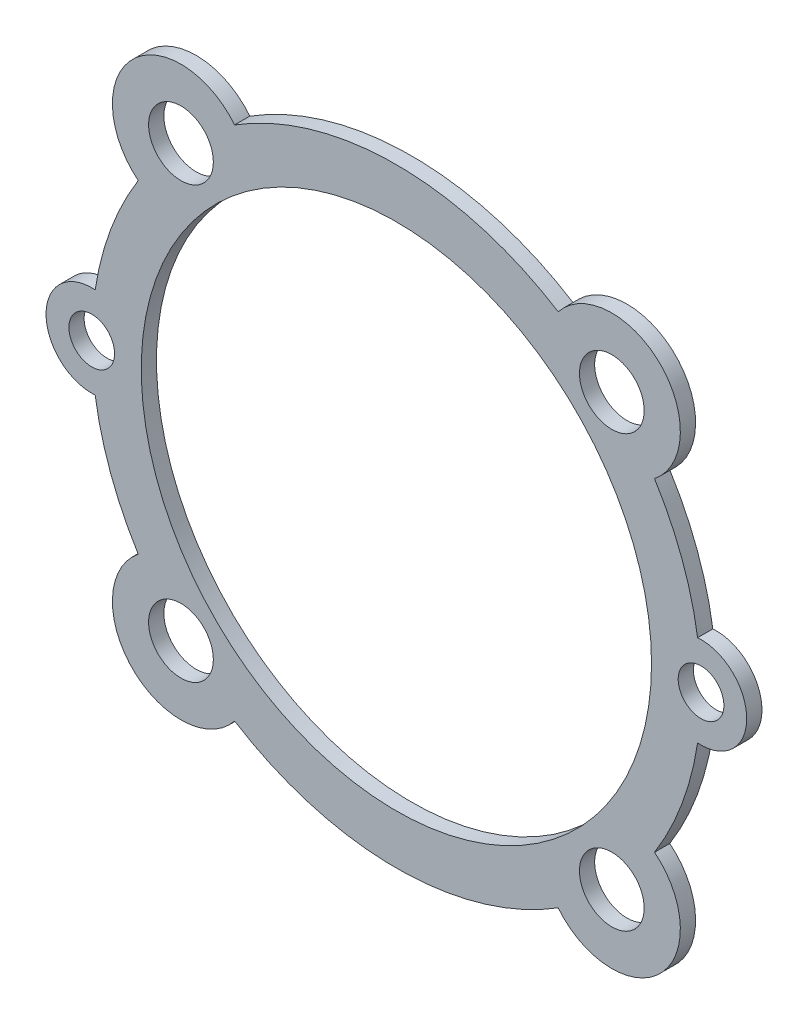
ISO-10303-21;
HEADER;
FILE_DESCRIPTION(('STEP AP214'),'2;1');
FILE_NAME('part.step','',(''),(''),'','','');
FILE_SCHEMA(('AUTOMOTIVE_DESIGN { 1 0 10303 214 1 1 1 1 }'));
ENDSEC;
DATA;
#1=APPLICATION_CONTEXT('core data for automotive mechanical design processes');
#2=APPLICATION_PROTOCOL_DEFINITION('international standard','automotive_design',2000,#1);
#3=PRODUCT_CONTEXT('',#1,'mechanical');
#4=PRODUCT('Part','Part','',(#3));
#5=PRODUCT_RELATED_PRODUCT_CATEGORY('part','',(#4));
#6=PRODUCT_DEFINITION_FORMATION('','',#4);
#7=PRODUCT_DEFINITION_CONTEXT('part definition',#1,'design');
#8=PRODUCT_DEFINITION('design','',#6,#7);
#9=PRODUCT_DEFINITION_SHAPE('','',#8);
#10=(LENGTH_UNIT() NAMED_UNIT(*) SI_UNIT(.MILLI.,.METRE.));
#11=(NAMED_UNIT(*) PLANE_ANGLE_UNIT() SI_UNIT($,.RADIAN.));
#12=(NAMED_UNIT(*) SI_UNIT($,.STERADIAN.) SOLID_ANGLE_UNIT());
#13=UNCERTAINTY_MEASURE_WITH_UNIT(LENGTH_MEASURE(1.E-05),#10,'distance_accuracy_value','');
#14=(GEOMETRIC_REPRESENTATION_CONTEXT(3) GLOBAL_UNCERTAINTY_ASSIGNED_CONTEXT((#13)) GLOBAL_UNIT_ASSIGNED_CONTEXT((#10,
#11,#12)) REPRESENTATION_CONTEXT('',''));
#15=CARTESIAN_POINT('',(0.,0.,0.));
#16=DIRECTION('',(0.,0.,1.));
#17=DIRECTION('',(1.,0.,0.));
#18=AXIS2_PLACEMENT_3D('',#15,#16,#17);
#19=CARTESIAN_POINT('',(14.1421356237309,14.142135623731,2.));
#20=DIRECTION('',(0.,0.,1.));
#21=DIRECTION('',(1.,0.,0.));
#22=AXIS2_PLACEMENT_3D('',#19,#20,#21);
#23=PLANE('',#22);
#24=CARTESIAN_POINT('',(-39.9999999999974,0.,2.));
#25=DIRECTION('',(0.,0.,1.));
#26=DIRECTION('',(1.,0.,0.));
#27=AXIS2_PLACEMENT_3D('',#24,#25,#26);
#28=CIRCLE('',#27,3.);
#29=CARTESIAN_POINT('',(-36.9999999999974,0.,2.));
#30=VERTEX_POINT('',#29);
#31=EDGE_CURVE('E295',#30,#30,#28,.T.);
#32=ORIENTED_EDGE('',*,*,#31,.F.);
#33=EDGE_LOOP('',(#32));
#34=FACE_BOUND('',#33,.T.);
#35=CARTESIAN_POINT('',(39.9999999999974,0.,2.));
#36=DIRECTION('',(0.,0.,1.));
#37=DIRECTION('',(1.,0.,0.));
#38=AXIS2_PLACEMENT_3D('',#35,#36,#37);
#39=CIRCLE('',#38,3.);
#40=CARTESIAN_POINT('',(42.9999999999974,0.,2.));
#41=VERTEX_POINT('',#40);
#42=EDGE_CURVE('E297',#41,#41,#39,.T.);
#43=ORIENTED_EDGE('',*,*,#42,.F.);
#44=EDGE_LOOP('',(#43));
#45=FACE_BOUND('',#44,.T.);
#46=CARTESIAN_POINT('',(-28.2842712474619,28.2842712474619,2.));
#47=DIRECTION('',(0.,0.,1.));
#48=DIRECTION('',(1.,0.,0.));
#49=AXIS2_PLACEMENT_3D('',#46,#47,#48);
#50=CIRCLE('',#49,4.25);
#51=CARTESIAN_POINT('',(-24.0342712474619,28.2842712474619,2.));
#52=VERTEX_POINT('',#51);
#53=EDGE_CURVE('E308',#52,#52,#50,.T.);
#54=ORIENTED_EDGE('',*,*,#53,.F.);
#55=EDGE_LOOP('',(#54));
#56=FACE_BOUND('',#55,.T.);
#57=CARTESIAN_POINT('',(28.2842712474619,28.284271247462,2.));
#58=DIRECTION('',(0.,0.,1.));
#59=DIRECTION('',(1.,0.,0.));
#60=AXIS2_PLACEMENT_3D('',#57,#58,#59);
#61=CIRCLE('',#60,4.25);
#62=CARTESIAN_POINT('',(32.5342712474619,28.284271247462,2.));
#63=VERTEX_POINT('',#62);
#64=EDGE_CURVE('E314',#63,#63,#61,.T.);
#65=ORIENTED_EDGE('',*,*,#64,.F.);
#66=EDGE_LOOP('',(#65));
#67=FACE_BOUND('',#66,.T.);
#68=CARTESIAN_POINT('',(28.2842712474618,-28.284271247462,2.));
#69=DIRECTION('',(0.,0.,1.));
#70=DIRECTION('',(1.,0.,0.));
#71=AXIS2_PLACEMENT_3D('',#68,#69,#70);
#72=CIRCLE('',#71,4.25);
#73=CARTESIAN_POINT('',(32.5342712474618,-28.284271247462,2.));
#74=VERTEX_POINT('',#73);
#75=EDGE_CURVE('E320',#74,#74,#72,.T.);
#76=ORIENTED_EDGE('',*,*,#75,.F.);
#77=EDGE_LOOP('',(#76));
#78=FACE_BOUND('',#77,.T.);
#79=CARTESIAN_POINT('',(-28.2842712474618,-28.284271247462,2.));
#80=DIRECTION('',(0.,0.,1.));
#81=DIRECTION('',(1.,0.,0.));
#82=AXIS2_PLACEMENT_3D('',#79,#80,#81);
#83=CIRCLE('',#82,4.25);
#84=CARTESIAN_POINT('',(-24.0342712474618,-28.284271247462,2.));
#85=VERTEX_POINT('',#84);
#86=EDGE_CURVE('E326',#85,#85,#83,.T.);
#87=ORIENTED_EDGE('',*,*,#86,.F.);
#88=EDGE_LOOP('',(#87));
#89=FACE_BOUND('',#88,.T.);
#90=CARTESIAN_POINT('',(0.,0.,2.));
#91=DIRECTION('',(0.,0.,1.));
#92=DIRECTION('',(1.,0.,0.));
#93=AXIS2_PLACEMENT_3D('',#90,#91,#92);
#94=CIRCLE('',#93,40.);
#95=CARTESIAN_POINT('',(39.55,5.98310120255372,2.));
#96=VERTEX_POINT('',#95);
#97=CARTESIAN_POINT('',(33.8918864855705,21.2447647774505,2.));
#98=VERTEX_POINT('',#97);
#99=EDGE_CURVE('E175',#96,#98,#94,.T.);
#100=ORIENTED_EDGE('',*,*,#99,.T.);
#101=CARTESIAN_POINT('',(28.2842712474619,28.284271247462,2.));
#102=DIRECTION('',(0.,0.,1.));
#103=DIRECTION('',(1.,0.,0.));
#104=AXIS2_PLACEMENT_3D('',#101,#102,#103);
#105=CIRCLE('',#104,9.00000000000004);
#106=CARTESIAN_POINT('',(21.2447647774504,33.8918864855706,2.));
#107=VERTEX_POINT('',#106);
#108=EDGE_CURVE('E103',#98,#107,#105,.T.);
#109=ORIENTED_EDGE('',*,*,#108,.T.);
#110=CARTESIAN_POINT('',(0.,0.,2.));
#111=DIRECTION('',(0.,0.,1.));
#112=DIRECTION('',(1.,0.,0.));
#113=AXIS2_PLACEMENT_3D('',#110,#111,#112);
#114=CIRCLE('',#113,40.);
#115=CARTESIAN_POINT('',(-21.2447647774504,33.8918864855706,2.));
#116=VERTEX_POINT('',#115);
#117=EDGE_CURVE('E202',#107,#116,#114,.T.);
#118=ORIENTED_EDGE('',*,*,#117,.T.);
#119=CARTESIAN_POINT('',(-28.2842712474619,28.2842712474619,2.));
#120=DIRECTION('',(0.,0.,1.));
#121=DIRECTION('',(1.,0.,0.));
#122=AXIS2_PLACEMENT_3D('',#119,#120,#121);
#123=CIRCLE('',#122,9.00000000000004);
#124=CARTESIAN_POINT('',(-33.8918864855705,21.2447647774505,2.));
#125=VERTEX_POINT('',#124);
#126=EDGE_CURVE('E221',#116,#125,#123,.T.);
#127=ORIENTED_EDGE('',*,*,#126,.T.);
#128=CARTESIAN_POINT('',(0.,0.,2.));
#129=DIRECTION('',(0.,0.,1.));
#130=DIRECTION('',(1.,0.,0.));
#131=AXIS2_PLACEMENT_3D('',#128,#129,#130);
#132=CIRCLE('',#131,40.);
#133=CARTESIAN_POINT('',(-39.55,5.98310120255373,2.));
#134=VERTEX_POINT('',#133);
#135=EDGE_CURVE('E218',#125,#134,#132,.T.);
#136=ORIENTED_EDGE('',*,*,#135,.T.);
#137=CARTESIAN_POINT('',(-39.9999999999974,0.,2.));
#138=DIRECTION('',(0.,0.,1.));
#139=DIRECTION('',(1.,0.,0.));
#140=AXIS2_PLACEMENT_3D('',#137,#138,#139);
#141=CIRCLE('',#140,5.9999999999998);
#142=CARTESIAN_POINT('',(-39.55,-5.98310120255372,2.));
#143=VERTEX_POINT('',#142);
#144=EDGE_CURVE('E220',#134,#143,#141,.T.);
#145=ORIENTED_EDGE('',*,*,#144,.T.);
#146=CARTESIAN_POINT('',(0.,0.,2.));
#147=DIRECTION('',(0.,0.,1.));
#148=DIRECTION('',(1.,0.,0.));
#149=AXIS2_PLACEMENT_3D('',#146,#147,#148);
#150=CIRCLE('',#149,40.);
#151=CARTESIAN_POINT('',(-33.8918864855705,-21.2447647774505,2.));
#152=VERTEX_POINT('',#151);
#153=EDGE_CURVE('E223',#143,#152,#150,.T.);
#154=ORIENTED_EDGE('',*,*,#153,.T.);
#155=CARTESIAN_POINT('',(-28.2842712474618,-28.284271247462,2.));
#156=DIRECTION('',(0.,0.,1.));
#157=DIRECTION('',(1.,0.,0.));
#158=AXIS2_PLACEMENT_3D('',#155,#156,#157);
#159=CIRCLE('',#158,9.00000000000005);
#160=CARTESIAN_POINT('',(-21.2447647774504,-33.8918864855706,2.));
#161=VERTEX_POINT('',#160);
#162=EDGE_CURVE('E229',#152,#161,#159,.T.);
#163=ORIENTED_EDGE('',*,*,#162,.T.);
#164=CARTESIAN_POINT('',(0.,0.,2.));
#165=DIRECTION('',(0.,0.,1.));
#166=DIRECTION('',(1.,0.,0.));
#167=AXIS2_PLACEMENT_3D('',#164,#165,#166);
#168=CIRCLE('',#167,40.);
#169=CARTESIAN_POINT('',(21.2447647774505,-33.8918864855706,2.));
#170=VERTEX_POINT('',#169);
#171=EDGE_CURVE('E134',#161,#170,#168,.T.);
#172=ORIENTED_EDGE('',*,*,#171,.T.);
#173=CARTESIAN_POINT('',(28.2842712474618,-28.284271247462,2.));
#174=DIRECTION('',(0.,0.,1.));
#175=DIRECTION('',(1.,0.,0.));
#176=AXIS2_PLACEMENT_3D('',#173,#174,#175);
#177=CIRCLE('',#176,8.99999999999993);
#178=CARTESIAN_POINT('',(33.8918864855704,-21.2447647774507,2.));
#179=VERTEX_POINT('',#178);
#180=EDGE_CURVE('E128',#170,#179,#177,.T.);
#181=ORIENTED_EDGE('',*,*,#180,.T.);
#182=CARTESIAN_POINT('',(0.,0.,2.));
#183=DIRECTION('',(0.,0.,1.));
#184=DIRECTION('',(1.,0.,0.));
#185=AXIS2_PLACEMENT_3D('',#182,#183,#184);
#186=CIRCLE('',#185,40.);
#187=CARTESIAN_POINT('',(39.55,-5.98310120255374,2.));
#188=VERTEX_POINT('',#187);
#189=EDGE_CURVE('E132',#179,#188,#186,.T.);
#190=ORIENTED_EDGE('',*,*,#189,.T.);
#191=CARTESIAN_POINT('',(39.9999999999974,0.,2.));
#192=DIRECTION('',(0.,0.,1.));
#193=DIRECTION('',(1.,0.,0.));
#194=AXIS2_PLACEMENT_3D('',#191,#192,#193);
#195=CIRCLE('',#194,5.99999999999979);
#196=EDGE_CURVE('E48',#188,#96,#195,.T.);
#197=ORIENTED_EDGE('',*,*,#196,.T.);
#198=EDGE_LOOP('',(#100,#109,#118,#127,#136,#145,#154,#163,#172,#181,#190,#197));
#199=FACE_BOUND('',#198,.T.);
#200=CARTESIAN_POINT('',(0.,0.,2.));
#201=DIRECTION('',(0.,0.,1.));
#202=DIRECTION('',(1.,0.,0.));
#203=AXIS2_PLACEMENT_3D('',#200,#201,#202);
#204=CIRCLE('',#203,33.5);
#205=CARTESIAN_POINT('',(33.5,0.,2.));
#206=VERTEX_POINT('',#205);
#207=EDGE_CURVE('E156',#206,#206,#204,.T.);
#208=ORIENTED_EDGE('',*,*,#207,.F.);
#209=EDGE_LOOP('',(#208));
#210=FACE_BOUND('',#209,.T.);
#211=ADVANCED_FACE('F31',(#34,#45,#56,#67,#78,#89,#199,#210),#23,.T.);
#212=CARTESIAN_POINT('',(14.1421356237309,14.142135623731,0.));
#213=DIRECTION('',(0.,0.,1.));
#214=DIRECTION('',(1.,0.,0.));
#215=AXIS2_PLACEMENT_3D('',#212,#213,#214);
#216=PLANE('',#215);
#217=CARTESIAN_POINT('',(-39.9999999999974,0.,0.));
#218=DIRECTION('',(0.,0.,1.));
#219=DIRECTION('',(1.,0.,0.));
#220=AXIS2_PLACEMENT_3D('',#217,#218,#219);
#221=CIRCLE('',#220,3.);
#222=CARTESIAN_POINT('',(-36.9999999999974,0.,0.));
#223=VERTEX_POINT('',#222);
#224=EDGE_CURVE('E293',#223,#223,#221,.T.);
#225=ORIENTED_EDGE('',*,*,#224,.T.);
#226=EDGE_LOOP('',(#225));
#227=FACE_BOUND('',#226,.T.);
#228=CARTESIAN_POINT('',(39.9999999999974,0.,0.));
#229=DIRECTION('',(0.,0.,1.));
#230=DIRECTION('',(1.,0.,0.));
#231=AXIS2_PLACEMENT_3D('',#228,#229,#230);
#232=CIRCLE('',#231,3.);
#233=CARTESIAN_POINT('',(42.9999999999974,0.,0.));
#234=VERTEX_POINT('',#233);
#235=EDGE_CURVE('E300',#234,#234,#232,.T.);
#236=ORIENTED_EDGE('',*,*,#235,.T.);
#237=EDGE_LOOP('',(#236));
#238=FACE_BOUND('',#237,.T.);
#239=CARTESIAN_POINT('',(-28.2842712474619,28.2842712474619,0.));
#240=DIRECTION('',(0.,0.,1.));
#241=DIRECTION('',(1.,0.,0.));
#242=AXIS2_PLACEMENT_3D('',#239,#240,#241);
#243=CIRCLE('',#242,4.25);
#244=CARTESIAN_POINT('',(-24.0342712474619,28.2842712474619,0.));
#245=VERTEX_POINT('',#244);
#246=EDGE_CURVE('E303',#245,#245,#243,.T.);
#247=ORIENTED_EDGE('',*,*,#246,.T.);
#248=EDGE_LOOP('',(#247));
#249=FACE_BOUND('',#248,.T.);
#250=CARTESIAN_POINT('',(28.2842712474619,28.284271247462,0.));
#251=DIRECTION('',(0.,0.,1.));
#252=DIRECTION('',(1.,0.,0.));
#253=AXIS2_PLACEMENT_3D('',#250,#251,#252);
#254=CIRCLE('',#253,4.25);
#255=CARTESIAN_POINT('',(32.5342712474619,28.284271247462,0.));
#256=VERTEX_POINT('',#255);
#257=EDGE_CURVE('E311',#256,#256,#254,.T.);
#258=ORIENTED_EDGE('',*,*,#257,.T.);
#259=EDGE_LOOP('',(#258));
#260=FACE_BOUND('',#259,.T.);
#261=CARTESIAN_POINT('',(28.2842712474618,-28.284271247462,0.));
#262=DIRECTION('',(0.,0.,1.));
#263=DIRECTION('',(1.,0.,0.));
#264=AXIS2_PLACEMENT_3D('',#261,#262,#263);
#265=CIRCLE('',#264,4.25);
#266=CARTESIAN_POINT('',(32.5342712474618,-28.284271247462,0.));
#267=VERTEX_POINT('',#266);
#268=EDGE_CURVE('E317',#267,#267,#265,.T.);
#269=ORIENTED_EDGE('',*,*,#268,.T.);
#270=EDGE_LOOP('',(#269));
#271=FACE_BOUND('',#270,.T.);
#272=CARTESIAN_POINT('',(-28.2842712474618,-28.284271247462,0.));
#273=DIRECTION('',(0.,0.,1.));
#274=DIRECTION('',(1.,0.,0.));
#275=AXIS2_PLACEMENT_3D('',#272,#273,#274);
#276=CIRCLE('',#275,4.25);
#277=CARTESIAN_POINT('',(-24.0342712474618,-28.284271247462,0.));
#278=VERTEX_POINT('',#277);
#279=EDGE_CURVE('E323',#278,#278,#276,.T.);
#280=ORIENTED_EDGE('',*,*,#279,.T.);
#281=EDGE_LOOP('',(#280));
#282=FACE_BOUND('',#281,.T.);
#283=CARTESIAN_POINT('',(0.,0.,0.));
#284=DIRECTION('',(0.,0.,1.));
#285=DIRECTION('',(1.,0.,0.));
#286=AXIS2_PLACEMENT_3D('',#283,#284,#285);
#287=CIRCLE('',#286,40.);
#288=CARTESIAN_POINT('',(39.55,5.98310120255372,0.));
#289=VERTEX_POINT('',#288);
#290=CARTESIAN_POINT('',(33.8918864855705,21.2447647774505,0.));
#291=VERTEX_POINT('',#290);
#292=EDGE_CURVE('E152',#289,#291,#287,.T.);
#293=ORIENTED_EDGE('',*,*,#292,.F.);
#294=CARTESIAN_POINT('',(39.9999999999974,0.,0.));
#295=DIRECTION('',(0.,0.,1.));
#296=DIRECTION('',(1.,0.,0.));
#297=AXIS2_PLACEMENT_3D('',#294,#295,#296);
#298=CIRCLE('',#297,5.99999999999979);
#299=CARTESIAN_POINT('',(39.55,-5.98310120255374,0.));
#300=VERTEX_POINT('',#299);
#301=EDGE_CURVE('E95',#300,#289,#298,.T.);
#302=ORIENTED_EDGE('',*,*,#301,.F.);
#303=CARTESIAN_POINT('',(0.,0.,0.));
#304=DIRECTION('',(0.,0.,1.));
#305=DIRECTION('',(1.,0.,0.));
#306=AXIS2_PLACEMENT_3D('',#303,#304,#305);
#307=CIRCLE('',#306,40.);
#308=CARTESIAN_POINT('',(33.8918864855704,-21.2447647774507,0.));
#309=VERTEX_POINT('',#308);
#310=EDGE_CURVE('E89',#309,#300,#307,.T.);
#311=ORIENTED_EDGE('',*,*,#310,.F.);
#312=CARTESIAN_POINT('',(28.2842712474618,-28.284271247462,0.));
#313=DIRECTION('',(0.,0.,1.));
#314=DIRECTION('',(1.,0.,0.));
#315=AXIS2_PLACEMENT_3D('',#312,#313,#314);
#316=CIRCLE('',#315,8.99999999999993);
#317=CARTESIAN_POINT('',(21.2447647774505,-33.8918864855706,0.));
#318=VERTEX_POINT('',#317);
#319=EDGE_CURVE('E142',#318,#309,#316,.T.);
#320=ORIENTED_EDGE('',*,*,#319,.F.);
#321=CARTESIAN_POINT('',(0.,0.,0.));
#322=DIRECTION('',(0.,0.,1.));
#323=DIRECTION('',(1.,0.,0.));
#324=AXIS2_PLACEMENT_3D('',#321,#322,#323);
#325=CIRCLE('',#324,40.);
#326=CARTESIAN_POINT('',(-21.2447647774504,-33.8918864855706,0.));
#327=VERTEX_POINT('',#326);
#328=EDGE_CURVE('E170',#327,#318,#325,.T.);
#329=ORIENTED_EDGE('',*,*,#328,.F.);
#330=CARTESIAN_POINT('',(-28.2842712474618,-28.284271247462,0.));
#331=DIRECTION('',(0.,0.,1.));
#332=DIRECTION('',(1.,0.,0.));
#333=AXIS2_PLACEMENT_3D('',#330,#331,#332);
#334=CIRCLE('',#333,9.00000000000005);
#335=CARTESIAN_POINT('',(-33.8918864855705,-21.2447647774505,0.));
#336=VERTEX_POINT('',#335);
#337=EDGE_CURVE('E168',#336,#327,#334,.T.);
#338=ORIENTED_EDGE('',*,*,#337,.F.);
#339=CARTESIAN_POINT('',(0.,0.,0.));
#340=DIRECTION('',(0.,0.,1.));
#341=DIRECTION('',(1.,0.,0.));
#342=AXIS2_PLACEMENT_3D('',#339,#340,#341);
#343=CIRCLE('',#342,40.);
#344=CARTESIAN_POINT('',(-39.55,-5.98310120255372,0.));
#345=VERTEX_POINT('',#344);
#346=EDGE_CURVE('E166',#345,#336,#343,.T.);
#347=ORIENTED_EDGE('',*,*,#346,.F.);
#348=CARTESIAN_POINT('',(-39.9999999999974,0.,0.));
#349=DIRECTION('',(0.,0.,1.));
#350=DIRECTION('',(1.,0.,0.));
#351=AXIS2_PLACEMENT_3D('',#348,#349,#350);
#352=CIRCLE('',#351,5.9999999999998);
#353=CARTESIAN_POINT('',(-39.55,5.98310120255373,0.));
#354=VERTEX_POINT('',#353);
#355=EDGE_CURVE('E164',#354,#345,#352,.T.);
#356=ORIENTED_EDGE('',*,*,#355,.F.);
#357=CARTESIAN_POINT('',(0.,0.,0.));
#358=DIRECTION('',(0.,0.,1.));
#359=DIRECTION('',(1.,0.,0.));
#360=AXIS2_PLACEMENT_3D('',#357,#358,#359);
#361=CIRCLE('',#360,40.);
#362=CARTESIAN_POINT('',(-33.8918864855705,21.2447647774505,0.));
#363=VERTEX_POINT('',#362);
#364=EDGE_CURVE('E162',#363,#354,#361,.T.);
#365=ORIENTED_EDGE('',*,*,#364,.F.);
#366=CARTESIAN_POINT('',(-28.2842712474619,28.2842712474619,0.));
#367=DIRECTION('',(0.,0.,1.));
#368=DIRECTION('',(1.,0.,0.));
#369=AXIS2_PLACEMENT_3D('',#366,#367,#368);
#370=CIRCLE('',#369,9.00000000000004);
#371=CARTESIAN_POINT('',(-21.2447647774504,33.8918864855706,0.));
#372=VERTEX_POINT('',#371);
#373=EDGE_CURVE('E160',#372,#363,#370,.T.);
#374=ORIENTED_EDGE('',*,*,#373,.F.);
#375=CARTESIAN_POINT('',(0.,0.,0.));
#376=DIRECTION('',(0.,0.,1.));
#377=DIRECTION('',(1.,0.,0.));
#378=AXIS2_PLACEMENT_3D('',#375,#376,#377);
#379=CIRCLE('',#378,40.);
#380=CARTESIAN_POINT('',(21.2447647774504,33.8918864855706,0.));
#381=VERTEX_POINT('',#380);
#382=EDGE_CURVE('E158',#381,#372,#379,.T.);
#383=ORIENTED_EDGE('',*,*,#382,.F.);
#384=CARTESIAN_POINT('',(28.2842712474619,28.284271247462,0.));
#385=DIRECTION('',(0.,0.,1.));
#386=DIRECTION('',(1.,0.,0.));
#387=AXIS2_PLACEMENT_3D('',#384,#385,#386);
#388=CIRCLE('',#387,9.00000000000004);
#389=EDGE_CURVE('E155',#291,#381,#388,.T.);
#390=ORIENTED_EDGE('',*,*,#389,.F.);
#391=EDGE_LOOP('',(#293,#302,#311,#320,#329,#338,#347,#356,#365,#374,#383,#390));
#392=FACE_BOUND('',#391,.T.);
#393=CARTESIAN_POINT('',(0.,0.,0.));
#394=DIRECTION('',(0.,0.,1.));
#395=DIRECTION('',(1.,0.,0.));
#396=AXIS2_PLACEMENT_3D('',#393,#394,#395);
#397=CIRCLE('',#396,33.5);
#398=CARTESIAN_POINT('',(33.5,0.,0.));
#399=VERTEX_POINT('',#398);
#400=EDGE_CURVE('E329',#399,#399,#397,.T.);
#401=ORIENTED_EDGE('',*,*,#400,.T.);
#402=EDGE_LOOP('',(#401));
#403=FACE_BOUND('',#402,.T.);
#404=ADVANCED_FACE('F206',(#227,#238,#249,#260,#271,#282,#392,#403),#216,.F.);
#405=CARTESIAN_POINT('',(0.,0.,2.));
#406=DIRECTION('',(0.,0.,-1.));
#407=DIRECTION('',(-1.,0.,0.));
#408=AXIS2_PLACEMENT_3D('',#405,#406,#407);
#409=CYLINDRICAL_SURFACE('',#408,40.);
#410=ORIENTED_EDGE('',*,*,#292,.T.);
#411=DIRECTION('',(0.,0.,-1.));
#412=VECTOR('',#411,1.);
#413=CARTESIAN_POINT('',(33.8918864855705,21.2447647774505,2.));
#414=LINE('',#413,#412);
#415=EDGE_CURVE('E11',#98,#291,#414,.T.);
#416=ORIENTED_EDGE('',*,*,#415,.F.);
#417=ORIENTED_EDGE('',*,*,#99,.F.);
#418=DIRECTION('',(0.,0.,-1.));
#419=VECTOR('',#418,1.);
#420=CARTESIAN_POINT('',(39.55,5.98310120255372,2.));
#421=LINE('',#420,#419);
#422=EDGE_CURVE('E148',#96,#289,#421,.T.);
#423=ORIENTED_EDGE('',*,*,#422,.T.);
#424=EDGE_LOOP('',(#410,#416,#417,#423));
#425=FACE_BOUND('',#424,.T.);
#426=ADVANCED_FACE('F33',(#425),#409,.T.);
#427=CARTESIAN_POINT('',(28.2842712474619,28.284271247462,2.));
#428=DIRECTION('',(0.,0.,-1.));
#429=DIRECTION('',(-1.,0.,0.));
#430=AXIS2_PLACEMENT_3D('',#427,#428,#429);
#431=CYLINDRICAL_SURFACE('',#430,9.00000000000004);
#432=ORIENTED_EDGE('',*,*,#389,.T.);
#433=DIRECTION('',(0.,0.,-1.));
#434=VECTOR('',#433,1.);
#435=CARTESIAN_POINT('',(21.2447647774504,33.8918864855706,2.));
#436=LINE('',#435,#434);
#437=EDGE_CURVE('E40',#107,#381,#436,.T.);
#438=ORIENTED_EDGE('',*,*,#437,.F.);
#439=ORIENTED_EDGE('',*,*,#108,.F.);
#440=ORIENTED_EDGE('',*,*,#415,.T.);
#441=EDGE_LOOP('',(#432,#438,#439,#440));
#442=FACE_BOUND('',#441,.T.);
#443=ADVANCED_FACE('F466',(#442),#431,.T.);
#444=CARTESIAN_POINT('',(0.,0.,2.));
#445=DIRECTION('',(0.,0.,-1.));
#446=DIRECTION('',(-1.,0.,0.));
#447=AXIS2_PLACEMENT_3D('',#444,#445,#446);
#448=CYLINDRICAL_SURFACE('',#447,40.);
#449=ORIENTED_EDGE('',*,*,#382,.T.);
#450=DIRECTION('',(0.,0.,-1.));
#451=VECTOR('',#450,1.);
#452=CARTESIAN_POINT('',(-21.2447647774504,33.8918864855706,2.));
#453=LINE('',#452,#451);
#454=EDGE_CURVE('E194',#116,#372,#453,.T.);
#455=ORIENTED_EDGE('',*,*,#454,.F.);
#456=ORIENTED_EDGE('',*,*,#117,.F.);
#457=ORIENTED_EDGE('',*,*,#437,.T.);
#458=EDGE_LOOP('',(#449,#455,#456,#457));
#459=FACE_BOUND('',#458,.T.);
#460=ADVANCED_FACE('F200',(#459),#448,.T.);
#461=CARTESIAN_POINT('',(-28.2842712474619,28.2842712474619,2.));
#462=DIRECTION('',(0.,0.,-1.));
#463=DIRECTION('',(-1.,0.,0.));
#464=AXIS2_PLACEMENT_3D('',#461,#462,#463);
#465=CYLINDRICAL_SURFACE('',#464,9.00000000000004);
#466=ORIENTED_EDGE('',*,*,#373,.T.);
#467=DIRECTION('',(0.,0.,-1.));
#468=VECTOR('',#467,1.);
#469=CARTESIAN_POINT('',(-33.8918864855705,21.2447647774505,2.));
#470=LINE('',#469,#468);
#471=EDGE_CURVE('E191',#125,#363,#470,.T.);
#472=ORIENTED_EDGE('',*,*,#471,.F.);
#473=ORIENTED_EDGE('',*,*,#126,.F.);
#474=ORIENTED_EDGE('',*,*,#454,.T.);
#475=EDGE_LOOP('',(#466,#472,#473,#474));
#476=FACE_BOUND('',#475,.T.);
#477=ADVANCED_FACE('F212',(#476),#465,.T.);
#478=CARTESIAN_POINT('',(0.,0.,2.));
#479=DIRECTION('',(0.,0.,-1.));
#480=DIRECTION('',(-1.,0.,0.));
#481=AXIS2_PLACEMENT_3D('',#478,#479,#480);
#482=CYLINDRICAL_SURFACE('',#481,40.);
#483=ORIENTED_EDGE('',*,*,#364,.T.);
#484=DIRECTION('',(0.,0.,-1.));
#485=VECTOR('',#484,1.);
#486=CARTESIAN_POINT('',(-39.55,5.98310120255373,2.));
#487=LINE('',#486,#485);
#488=EDGE_CURVE('E188',#134,#354,#487,.T.);
#489=ORIENTED_EDGE('',*,*,#488,.F.);
#490=ORIENTED_EDGE('',*,*,#135,.F.);
#491=ORIENTED_EDGE('',*,*,#471,.T.);
#492=EDGE_LOOP('',(#483,#489,#490,#491));
#493=FACE_BOUND('',#492,.T.);
#494=ADVANCED_FACE('F216',(#493),#482,.T.);
#495=CARTESIAN_POINT('',(-39.9999999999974,0.,2.));
#496=DIRECTION('',(0.,0.,-1.));
#497=DIRECTION('',(-1.,0.,0.));
#498=AXIS2_PLACEMENT_3D('',#495,#496,#497);
#499=CYLINDRICAL_SURFACE('',#498,5.9999999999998);
#500=ORIENTED_EDGE('',*,*,#355,.T.);
#501=DIRECTION('',(0.,0.,-1.));
#502=VECTOR('',#501,1.);
#503=CARTESIAN_POINT('',(-39.55,-5.98310120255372,2.));
#504=LINE('',#503,#502);
#505=EDGE_CURVE('E185',#143,#345,#504,.T.);
#506=ORIENTED_EDGE('',*,*,#505,.F.);
#507=ORIENTED_EDGE('',*,*,#144,.F.);
#508=ORIENTED_EDGE('',*,*,#488,.T.);
#509=EDGE_LOOP('',(#500,#506,#507,#508));
#510=FACE_BOUND('',#509,.T.);
#511=ADVANCED_FACE('F431',(#510),#499,.T.);
#512=CARTESIAN_POINT('',(0.,0.,2.));
#513=DIRECTION('',(0.,0.,-1.));
#514=DIRECTION('',(-1.,0.,0.));
#515=AXIS2_PLACEMENT_3D('',#512,#513,#514);
#516=CYLINDRICAL_SURFACE('',#515,40.);
#517=ORIENTED_EDGE('',*,*,#346,.T.);
#518=DIRECTION('',(0.,0.,-1.));
#519=VECTOR('',#518,1.);
#520=CARTESIAN_POINT('',(-33.8918864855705,-21.2447647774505,2.));
#521=LINE('',#520,#519);
#522=EDGE_CURVE('E182',#152,#336,#521,.T.);
#523=ORIENTED_EDGE('',*,*,#522,.F.);
#524=ORIENTED_EDGE('',*,*,#153,.F.);
#525=ORIENTED_EDGE('',*,*,#505,.T.);
#526=EDGE_LOOP('',(#517,#523,#524,#525));
#527=FACE_BOUND('',#526,.T.);
#528=ADVANCED_FACE('F422',(#527),#516,.T.);
#529=CARTESIAN_POINT('',(-28.2842712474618,-28.284271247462,2.));
#530=DIRECTION('',(0.,0.,-1.));
#531=DIRECTION('',(-1.,0.,0.));
#532=AXIS2_PLACEMENT_3D('',#529,#530,#531);
#533=CYLINDRICAL_SURFACE('',#532,9.00000000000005);
#534=ORIENTED_EDGE('',*,*,#337,.T.);
#535=DIRECTION('',(0.,0.,-1.));
#536=VECTOR('',#535,1.);
#537=CARTESIAN_POINT('',(-21.2447647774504,-33.8918864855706,2.));
#538=LINE('',#537,#536);
#539=EDGE_CURVE('E179',#161,#327,#538,.T.);
#540=ORIENTED_EDGE('',*,*,#539,.F.);
#541=ORIENTED_EDGE('',*,*,#162,.F.);
#542=ORIENTED_EDGE('',*,*,#522,.T.);
#543=EDGE_LOOP('',(#534,#540,#541,#542));
#544=FACE_BOUND('',#543,.T.);
#545=ADVANCED_FACE('F235',(#544),#533,.T.);
#546=CARTESIAN_POINT('',(0.,0.,2.));
#547=DIRECTION('',(0.,0.,-1.));
#548=DIRECTION('',(-1.,0.,0.));
#549=AXIS2_PLACEMENT_3D('',#546,#547,#548);
#550=CYLINDRICAL_SURFACE('',#549,40.);
#551=ORIENTED_EDGE('',*,*,#328,.T.);
#552=DIRECTION('',(0.,0.,-1.));
#553=VECTOR('',#552,1.);
#554=CARTESIAN_POINT('',(21.2447647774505,-33.8918864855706,2.));
#555=LINE('',#554,#553);
#556=EDGE_CURVE('E143',#170,#318,#555,.T.);
#557=ORIENTED_EDGE('',*,*,#556,.F.);
#558=ORIENTED_EDGE('',*,*,#171,.F.);
#559=ORIENTED_EDGE('',*,*,#539,.T.);
#560=EDGE_LOOP('',(#551,#557,#558,#559));
#561=FACE_BOUND('',#560,.T.);
#562=ADVANCED_FACE('F239',(#561),#550,.T.);
#563=CARTESIAN_POINT('',(28.2842712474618,-28.284271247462,2.));
#564=DIRECTION('',(0.,0.,-1.));
#565=DIRECTION('',(-1.,0.,0.));
#566=AXIS2_PLACEMENT_3D('',#563,#564,#565);
#567=CYLINDRICAL_SURFACE('',#566,8.99999999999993);
#568=ORIENTED_EDGE('',*,*,#319,.T.);
#569=DIRECTION('',(0.,0.,-1.));
#570=VECTOR('',#569,1.);
#571=CARTESIAN_POINT('',(33.8918864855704,-21.2447647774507,2.));
#572=LINE('',#571,#570);
#573=EDGE_CURVE('E139',#179,#309,#572,.T.);
#574=ORIENTED_EDGE('',*,*,#573,.F.);
#575=ORIENTED_EDGE('',*,*,#180,.F.);
#576=ORIENTED_EDGE('',*,*,#556,.T.);
#577=EDGE_LOOP('',(#568,#574,#575,#576));
#578=FACE_BOUND('',#577,.T.);
#579=ADVANCED_FACE('F140',(#578),#567,.T.);
#580=CARTESIAN_POINT('',(0.,0.,2.));
#581=DIRECTION('',(0.,0.,-1.));
#582=DIRECTION('',(-1.,0.,0.));
#583=AXIS2_PLACEMENT_3D('',#580,#581,#582);
#584=CYLINDRICAL_SURFACE('',#583,40.);
#585=ORIENTED_EDGE('',*,*,#310,.T.);
#586=DIRECTION('',(0.,0.,-1.));
#587=VECTOR('',#586,1.);
#588=CARTESIAN_POINT('',(39.55,-5.98310120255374,2.));
#589=LINE('',#588,#587);
#590=EDGE_CURVE('E144',#188,#300,#589,.T.);
#591=ORIENTED_EDGE('',*,*,#590,.F.);
#592=ORIENTED_EDGE('',*,*,#189,.F.);
#593=ORIENTED_EDGE('',*,*,#573,.T.);
#594=EDGE_LOOP('',(#585,#591,#592,#593));
#595=FACE_BOUND('',#594,.T.);
#596=ADVANCED_FACE('F146',(#595),#584,.T.);
#597=CARTESIAN_POINT('',(39.9999999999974,0.,2.));
#598=DIRECTION('',(0.,0.,-1.));
#599=DIRECTION('',(-1.,0.,0.));
#600=AXIS2_PLACEMENT_3D('',#597,#598,#599);
#601=CYLINDRICAL_SURFACE('',#600,5.99999999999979);
#602=ORIENTED_EDGE('',*,*,#301,.T.);
#603=ORIENTED_EDGE('',*,*,#422,.F.);
#604=ORIENTED_EDGE('',*,*,#196,.F.);
#605=ORIENTED_EDGE('',*,*,#590,.T.);
#606=EDGE_LOOP('',(#602,#603,#604,#605));
#607=FACE_BOUND('',#606,.T.);
#608=ADVANCED_FACE('F243',(#607),#601,.T.);
#609=CARTESIAN_POINT('',(0.,0.,2.));
#610=DIRECTION('',(0.,0.,-1.));
#611=DIRECTION('',(-1.,0.,0.));
#612=AXIS2_PLACEMENT_3D('',#609,#610,#611);
#613=CYLINDRICAL_SURFACE('',#612,33.5);
#614=ORIENTED_EDGE('',*,*,#207,.T.);
#615=EDGE_LOOP('',(#614));
#616=FACE_BOUND('',#615,.T.);
#617=ORIENTED_EDGE('',*,*,#400,.F.);
#618=EDGE_LOOP('',(#617));
#619=FACE_BOUND('',#618,.T.);
#620=ADVANCED_FACE('F245',(#616,#619),#613,.F.);
#621=CARTESIAN_POINT('',(-28.2842712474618,-28.284271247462,2.));
#622=DIRECTION('',(0.,0.,1.));
#623=DIRECTION('',(1.,0.,0.));
#624=AXIS2_PLACEMENT_3D('',#621,#622,#623);
#625=CYLINDRICAL_SURFACE('',#624,4.25);
#626=ORIENTED_EDGE('',*,*,#279,.F.);
#627=EDGE_LOOP('',(#626));
#628=FACE_BOUND('',#627,.T.);
#629=ORIENTED_EDGE('',*,*,#86,.T.);
#630=EDGE_LOOP('',(#629));
#631=FACE_BOUND('',#630,.T.);
#632=ADVANCED_FACE('F251',(#628,#631),#625,.F.);
#633=CARTESIAN_POINT('',(28.2842712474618,-28.284271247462,2.));
#634=DIRECTION('',(0.,0.,1.));
#635=DIRECTION('',(1.,0.,0.));
#636=AXIS2_PLACEMENT_3D('',#633,#634,#635);
#637=CYLINDRICAL_SURFACE('',#636,4.25);
#638=ORIENTED_EDGE('',*,*,#268,.F.);
#639=EDGE_LOOP('',(#638));
#640=FACE_BOUND('',#639,.T.);
#641=ORIENTED_EDGE('',*,*,#75,.T.);
#642=EDGE_LOOP('',(#641));
#643=FACE_BOUND('',#642,.T.);
#644=ADVANCED_FACE('F268',(#640,#643),#637,.F.);
#645=CARTESIAN_POINT('',(28.2842712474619,28.284271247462,2.));
#646=DIRECTION('',(0.,0.,1.));
#647=DIRECTION('',(1.,0.,0.));
#648=AXIS2_PLACEMENT_3D('',#645,#646,#647);
#649=CYLINDRICAL_SURFACE('',#648,4.25);
#650=ORIENTED_EDGE('',*,*,#257,.F.);
#651=EDGE_LOOP('',(#650));
#652=FACE_BOUND('',#651,.T.);
#653=ORIENTED_EDGE('',*,*,#64,.T.);
#654=EDGE_LOOP('',(#653));
#655=FACE_BOUND('',#654,.T.);
#656=ADVANCED_FACE('F272',(#652,#655),#649,.F.);
#657=CARTESIAN_POINT('',(-28.2842712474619,28.2842712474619,2.));
#658=DIRECTION('',(0.,0.,1.));
#659=DIRECTION('',(1.,0.,0.));
#660=AXIS2_PLACEMENT_3D('',#657,#658,#659);
#661=CYLINDRICAL_SURFACE('',#660,4.25);
#662=ORIENTED_EDGE('',*,*,#246,.F.);
#663=EDGE_LOOP('',(#662));
#664=FACE_BOUND('',#663,.T.);
#665=ORIENTED_EDGE('',*,*,#53,.T.);
#666=EDGE_LOOP('',(#665));
#667=FACE_BOUND('',#666,.T.);
#668=ADVANCED_FACE('F276',(#664,#667),#661,.F.);
#669=CARTESIAN_POINT('',(39.9999999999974,0.,0.));
#670=DIRECTION('',(0.,0.,1.));
#671=DIRECTION('',(1.,0.,0.));
#672=AXIS2_PLACEMENT_3D('',#669,#670,#671);
#673=CYLINDRICAL_SURFACE('',#672,3.);
#674=ORIENTED_EDGE('',*,*,#235,.F.);
#675=EDGE_LOOP('',(#674));
#676=FACE_BOUND('',#675,.T.);
#677=ORIENTED_EDGE('',*,*,#42,.T.);
#678=EDGE_LOOP('',(#677));
#679=FACE_BOUND('',#678,.T.);
#680=ADVANCED_FACE('F280',(#676,#679),#673,.F.);
#681=CARTESIAN_POINT('',(-39.9999999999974,0.,0.));
#682=DIRECTION('',(0.,0.,1.));
#683=DIRECTION('',(1.,0.,0.));
#684=AXIS2_PLACEMENT_3D('',#681,#682,#683);
#685=CYLINDRICAL_SURFACE('',#684,3.);
#686=ORIENTED_EDGE('',*,*,#224,.F.);
#687=EDGE_LOOP('',(#686));
#688=FACE_BOUND('',#687,.T.);
#689=ORIENTED_EDGE('',*,*,#31,.T.);
#690=EDGE_LOOP('',(#689));
#691=FACE_BOUND('',#690,.T.);
#692=ADVANCED_FACE('F284',(#688,#691),#685,.F.);
#693=CLOSED_SHELL('',(#211,#404,#426,#443,#460,#477,#494,#511,#528,#545,#562,#579,#596,#608,
#620,#632,#644,#656,#668,#680,#692));
#694=MANIFOLD_SOLID_BREP('B2',#693);
#695=ADVANCED_BREP_SHAPE_REPRESENTATION('',(#18,#694),#14);
#696=SHAPE_DEFINITION_REPRESENTATION(#9,#695);
ENDSEC;
END-ISO-10303-21;
